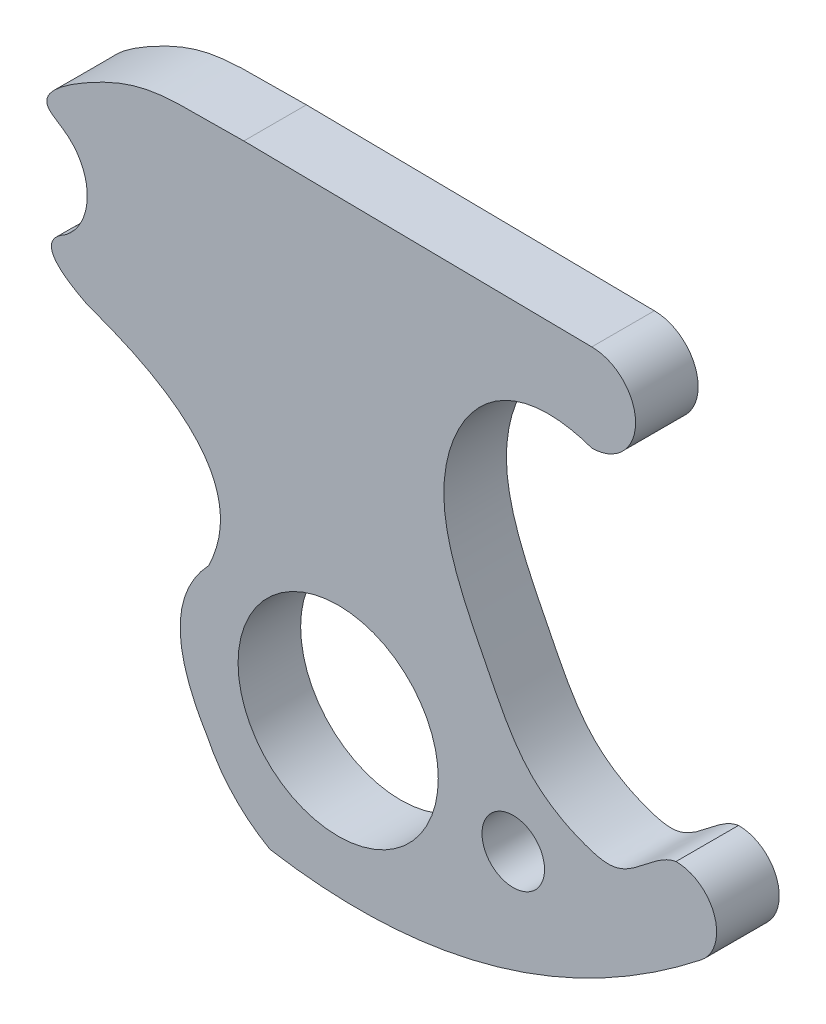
from build123d import *

# Parameters (mm, degrees)
ESQUISSE1_R          = 8
EXTRUSION1_DEPTH     = 5
D_GAGEMENT_M51_D     = 5
D_GAGEMENT_M51_DEPTH = 10
D_GAGEMENT_M51_TIP   = 1.502151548


with BuildPart() as part:
    # Esquisse1 → Extrusion1 (new body)
    with BuildSketch(Plane.XY):
        with BuildLine():
            ThreePointArc((28.986834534, -2.068378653), (30.070246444, 1.55244225), (26.995369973, 3.75))
            add(Edge.make_bspline(
                [(26.995369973, 3.75), (25.265634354, 3.446991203), (23.243823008, 0.258914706), (18.850698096, 1.460816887), (14.767766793, 3.817576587), (11.334276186, 10.8582014), (5.652709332, 21.587135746), (12.812368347, 31.608015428), (20.26558543, 29)],
                knots=[0, 0, 0, 0, 0.121513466, 0.169898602, 0.270902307, 0.413829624, 0.654507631, 1, 1, 1, 1], degree=3))
            ThreePointArc((20.26558543, 29), (23.76558543, 32.5), (20.26558543, 36))
            Line((20.26558543, 36), (-7.53876864, 36.350629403))
            add(Edge.make_bspline(
                [(-21.752957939, 22.759510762), (-19.513412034, 24.503592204), (-19.440600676, 28.828008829), (-24.583350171, 31.278640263), (-15.930862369, 37.065687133), (-13.252685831, 36.202656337), (-7.53876864, 36.350629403)],
                knots=[0, 0, 0, 0, 0.289181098, 0.355399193, 0.522693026, 1, 1, 1, 1], degree=3))
            add(Edge.make_bspline(
                [(-21.752957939, 22.759510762), (-24.741372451, 21.137730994), (-20.052632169, 18.7686088)],
                knots=[0, 0, 0, 1, 1, 1], degree=2))
            add(Edge.make_bspline(
                [(-20.052632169, 18.7686088), (-6.231944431, 13.947907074), (-10.353713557, 5.552690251)],
                knots=[0, 0, 0, 1, 1, 1], degree=2))
            add(Edge.make_bspline(
                [(-10.471942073, -6.296073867), (-14.836771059, 0.798292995), (-10.353713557, 5.552690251)],
                knots=[0, 0, 0, 1, 1, 1], degree=2))
            ThreePointArc((-10.471942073, -6.296073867), (-8.367905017, -9.354170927), (-5.440660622, -11.636750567))
            add(Edge.make_bspline(
                [(-5.440660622, -11.636750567), (12.955863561, -14.702152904), (28.986834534, -2.068378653)],
                knots=[0, 0, 0, 1, 1, 1], degree=2))
        make_face()
        Circle(ESQUISSE1_R, mode=Mode.SUBTRACT)
    extrude(amount=EXTRUSION1_DEPTH)

    # D_gagement M51
    with Locations(Plane(origin=(13.991343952, -2.059683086, 5), x_dir=(1, 0, 0), z_dir=(0, 0, 1))):
        with Locations((0, 0)):
            Hole(D_GAGEMENT_M51_D / 2, depth=D_GAGEMENT_M51_DEPTH)
            with Locations((0, 0, -(D_GAGEMENT_M51_DEPTH + D_GAGEMENT_M51_TIP / 2))):  # 118° drill point
                Cone(0, D_GAGEMENT_M51_D / 2, D_GAGEMENT_M51_TIP, mode=Mode.SUBTRACT)


solid = part.part
